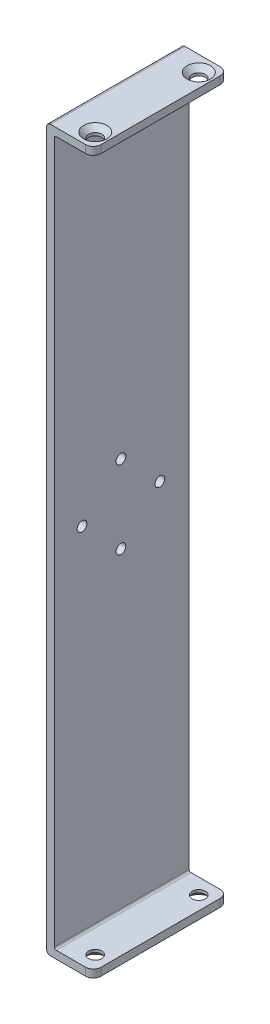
ISO-10303-21;
HEADER;
FILE_DESCRIPTION(('STEP AP214'),'2;1');
FILE_NAME('part.step','',(''),(''),'','','');
FILE_SCHEMA(('AUTOMOTIVE_DESIGN { 1 0 10303 214 1 1 1 1 }'));
ENDSEC;
DATA;
#1=APPLICATION_CONTEXT('core data for automotive mechanical design processes');
#2=APPLICATION_PROTOCOL_DEFINITION('international standard','automotive_design',2000,#1);
#3=PRODUCT_CONTEXT('',#1,'mechanical');
#4=PRODUCT('Part','Part','',(#3));
#5=PRODUCT_RELATED_PRODUCT_CATEGORY('part','',(#4));
#6=PRODUCT_DEFINITION_FORMATION('','',#4);
#7=PRODUCT_DEFINITION_CONTEXT('part definition',#1,'design');
#8=PRODUCT_DEFINITION('design','',#6,#7);
#9=PRODUCT_DEFINITION_SHAPE('','',#8);
#10=(LENGTH_UNIT() NAMED_UNIT(*) SI_UNIT(.MILLI.,.METRE.));
#11=(NAMED_UNIT(*) PLANE_ANGLE_UNIT() SI_UNIT($,.RADIAN.));
#12=(NAMED_UNIT(*) SI_UNIT($,.STERADIAN.) SOLID_ANGLE_UNIT());
#13=UNCERTAINTY_MEASURE_WITH_UNIT(LENGTH_MEASURE(1.E-05),#10,'distance_accuracy_value','');
#14=(GEOMETRIC_REPRESENTATION_CONTEXT(3) GLOBAL_UNCERTAINTY_ASSIGNED_CONTEXT((#13)) GLOBAL_UNIT_ASSIGNED_CONTEXT((#10,
#11,#12)) REPRESENTATION_CONTEXT('',''));
#15=CARTESIAN_POINT('',(0.,0.,0.));
#16=DIRECTION('',(0.,0.,1.));
#17=DIRECTION('',(1.,0.,0.));
#18=AXIS2_PLACEMENT_3D('',#15,#16,#17);
#19=CARTESIAN_POINT('',(0.,0.,34.6));
#20=DIRECTION('',(1.,0.,0.));
#21=DIRECTION('',(0.,0.,-1.));
#22=AXIS2_PLACEMENT_3D('',#19,#20,#21);
#23=PLANE('',#22);
#24=CARTESIAN_POINT('',(0.,102.5,17.5));
#25=DIRECTION('',(-1.,0.,0.));
#26=DIRECTION('',(0.,0.,1.));
#27=AXIS2_PLACEMENT_3D('',#24,#25,#26);
#28=CIRCLE('',#27,1.24999999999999);
#29=CARTESIAN_POINT('',(0.,102.5,18.75));
#30=VERTEX_POINT('',#29);
#31=EDGE_CURVE('E665',#30,#30,#28,.T.);
#32=ORIENTED_EDGE('',*,*,#31,.F.);
#33=EDGE_LOOP('',(#32));
#34=FACE_BOUND('',#33,.T.);
#35=CARTESIAN_POINT('',(0.,92.5000000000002,7.49999999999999));
#36=DIRECTION('',(-1.,0.,0.));
#37=DIRECTION('',(0.,0.,1.));
#38=AXIS2_PLACEMENT_3D('',#35,#36,#37);
#39=CIRCLE('',#38,1.24999999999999);
#40=CARTESIAN_POINT('',(0.,92.5000000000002,8.74999999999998));
#41=VERTEX_POINT('',#40);
#42=EDGE_CURVE('E659',#41,#41,#39,.T.);
#43=ORIENTED_EDGE('',*,*,#42,.F.);
#44=EDGE_LOOP('',(#43));
#45=FACE_BOUND('',#44,.T.);
#46=CARTESIAN_POINT('',(0.,82.5000000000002,17.5));
#47=DIRECTION('',(-1.,0.,0.));
#48=DIRECTION('',(0.,0.,1.));
#49=AXIS2_PLACEMENT_3D('',#46,#47,#48);
#50=CIRCLE('',#49,1.24999999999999);
#51=CARTESIAN_POINT('',(0.,82.5000000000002,18.75));
#52=VERTEX_POINT('',#51);
#53=EDGE_CURVE('E653',#52,#52,#50,.T.);
#54=ORIENTED_EDGE('',*,*,#53,.F.);
#55=EDGE_LOOP('',(#54));
#56=FACE_BOUND('',#55,.T.);
#57=CARTESIAN_POINT('',(0.,92.5000000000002,27.5));
#58=DIRECTION('',(-1.,0.,0.));
#59=DIRECTION('',(0.,0.,1.));
#60=AXIS2_PLACEMENT_3D('',#57,#58,#59);
#61=CIRCLE('',#60,1.24999999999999);
#62=CARTESIAN_POINT('',(0.,92.5000000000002,28.75));
#63=VERTEX_POINT('',#62);
#64=EDGE_CURVE('E647',#63,#63,#61,.T.);
#65=ORIENTED_EDGE('',*,*,#64,.F.);
#66=EDGE_LOOP('',(#65));
#67=FACE_BOUND('',#66,.T.);
#68=DIRECTION('',(0.,-1.,0.));
#69=VECTOR('',#68,1.);
#70=CARTESIAN_POINT('',(0.,0.,0.));
#71=LINE('',#70,#69);
#72=CARTESIAN_POINT('',(0.,184.,0.));
#73=VERTEX_POINT('',#72);
#74=CARTESIAN_POINT('',(0.,1.,0.));
#75=VERTEX_POINT('',#74);
#76=EDGE_CURVE('E177',#73,#75,#71,.T.);
#77=ORIENTED_EDGE('',*,*,#76,.T.);
#78=DIRECTION('',(0.,0.,-1.));
#79=VECTOR('',#78,1.);
#80=CARTESIAN_POINT('',(0.,1.,34.6));
#81=LINE('',#80,#79);
#82=CARTESIAN_POINT('',(0.,1.,34.6));
#83=VERTEX_POINT('',#82);
#84=EDGE_CURVE('E153',#75,#83,#81,.F.);
#85=ORIENTED_EDGE('',*,*,#84,.T.);
#86=DIRECTION('',(0.,-1.,0.));
#87=VECTOR('',#86,1.);
#88=CARTESIAN_POINT('',(0.,0.,34.6));
#89=LINE('',#88,#87);
#90=CARTESIAN_POINT('',(0.,184.,34.6));
#91=VERTEX_POINT('',#90);
#92=EDGE_CURVE('E191',#91,#83,#89,.T.);
#93=ORIENTED_EDGE('',*,*,#92,.F.);
#94=DIRECTION('',(0.,0.,-1.));
#95=VECTOR('',#94,1.);
#96=CARTESIAN_POINT('',(0.,184.,34.6));
#97=LINE('',#96,#95);
#98=EDGE_CURVE('E158',#91,#73,#97,.T.);
#99=ORIENTED_EDGE('',*,*,#98,.T.);
#100=EDGE_LOOP('',(#77,#85,#93,#99));
#101=FACE_BOUND('',#100,.T.);
#102=ADVANCED_FACE('F35',(#34,#45,#56,#67,#101),#23,.F.);
#103=CARTESIAN_POINT('',(0.,0.,34.6));
#104=DIRECTION('',(0.,1.,0.));
#105=DIRECTION('',(0.,0.,1.));
#106=AXIS2_PLACEMENT_3D('',#103,#104,#105);
#107=PLANE('',#106);
#108=CARTESIAN_POINT('',(8.50000000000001,0.,30.6));
#109=DIRECTION('',(0.,-1.,0.));
#110=DIRECTION('',(0.,0.,-1.));
#111=AXIS2_PLACEMENT_3D('',#108,#109,#110);
#112=CIRCLE('',#111,3.);
#113=CARTESIAN_POINT('',(8.50000000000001,0.,27.6));
#114=VERTEX_POINT('',#113);
#115=EDGE_CURVE('E641',#114,#114,#112,.T.);
#116=ORIENTED_EDGE('',*,*,#115,.F.);
#117=EDGE_LOOP('',(#116));
#118=FACE_BOUND('',#117,.T.);
#119=CARTESIAN_POINT('',(8.50000000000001,0.,4.));
#120=DIRECTION('',(0.,-1.,0.));
#121=DIRECTION('',(0.,0.,-1.));
#122=AXIS2_PLACEMENT_3D('',#119,#120,#121);
#123=CIRCLE('',#122,3.);
#124=CARTESIAN_POINT('',(8.50000000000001,0.,0.999999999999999));
#125=VERTEX_POINT('',#124);
#126=EDGE_CURVE('E252',#125,#125,#123,.T.);
#127=ORIENTED_EDGE('',*,*,#126,.F.);
#128=EDGE_LOOP('',(#127));
#129=FACE_BOUND('',#128,.T.);
#130=DIRECTION('',(0.,0.,-1.));
#131=VECTOR('',#130,1.);
#132=CARTESIAN_POINT('',(12.,0.,34.6));
#133=LINE('',#132,#131);
#134=CARTESIAN_POINT('',(12.,0.,32.6));
#135=VERTEX_POINT('',#134);
#136=CARTESIAN_POINT('',(12.,0.,2.));
#137=VERTEX_POINT('',#136);
#138=EDGE_CURVE('E170',#135,#137,#133,.T.);
#139=ORIENTED_EDGE('',*,*,#138,.F.);
#140=CARTESIAN_POINT('',(10.,0.,32.6));
#141=DIRECTION('',(0.,1.,0.));
#142=DIRECTION('',(0.,0.,1.));
#143=AXIS2_PLACEMENT_3D('',#140,#141,#142);
#144=CIRCLE('',#143,2.);
#145=CARTESIAN_POINT('',(10.,0.,34.6));
#146=VERTEX_POINT('',#145);
#147=EDGE_CURVE('E270',#135,#146,#144,.F.);
#148=ORIENTED_EDGE('',*,*,#147,.T.);
#149=DIRECTION('',(1.,0.,0.));
#150=VECTOR('',#149,1.);
#151=CARTESIAN_POINT('',(0.,0.,34.6));
#152=LINE('',#151,#150);
#153=CARTESIAN_POINT('',(1.,0.,34.6));
#154=VERTEX_POINT('',#153);
#155=EDGE_CURVE('E169',#154,#146,#152,.T.);
#156=ORIENTED_EDGE('',*,*,#155,.F.);
#157=DIRECTION('',(0.,0.,-1.));
#158=VECTOR('',#157,1.);
#159=CARTESIAN_POINT('',(1.,0.,34.6));
#160=LINE('',#159,#158);
#161=CARTESIAN_POINT('',(1.,0.,0.));
#162=VERTEX_POINT('',#161);
#163=EDGE_CURVE('E152',#154,#162,#160,.T.);
#164=ORIENTED_EDGE('',*,*,#163,.T.);
#165=DIRECTION('',(1.,0.,0.));
#166=VECTOR('',#165,1.);
#167=CARTESIAN_POINT('',(0.,0.,0.));
#168=LINE('',#167,#166);
#169=CARTESIAN_POINT('',(10.,0.,0.));
#170=VERTEX_POINT('',#169);
#171=EDGE_CURVE('E166',#162,#170,#168,.T.);
#172=ORIENTED_EDGE('',*,*,#171,.T.);
#173=CARTESIAN_POINT('',(10.,0.,2.));
#174=DIRECTION('',(0.,1.,0.));
#175=DIRECTION('',(0.,0.,1.));
#176=AXIS2_PLACEMENT_3D('',#173,#174,#175);
#177=CIRCLE('',#176,2.);
#178=EDGE_CURVE('E268',#170,#137,#177,.F.);
#179=ORIENTED_EDGE('',*,*,#178,.T.);
#180=EDGE_LOOP('',(#139,#148,#156,#164,#172,#179));
#181=FACE_BOUND('',#180,.T.);
#182=ADVANCED_FACE('F165',(#118,#129,#181),#107,.F.);
#183=CARTESIAN_POINT('',(12.,0.,34.6));
#184=DIRECTION('',(-1.,0.,0.));
#185=DIRECTION('',(0.,0.,1.));
#186=AXIS2_PLACEMENT_3D('',#183,#184,#185);
#187=PLANE('',#186);
#188=DIRECTION('',(0.,0.,-1.));
#189=VECTOR('',#188,1.);
#190=CARTESIAN_POINT('',(12.,2.,34.6));
#191=LINE('',#190,#189);
#192=CARTESIAN_POINT('',(12.,2.,32.6));
#193=VERTEX_POINT('',#192);
#194=CARTESIAN_POINT('',(12.,2.,2.));
#195=VERTEX_POINT('',#194);
#196=EDGE_CURVE('E198',#193,#195,#191,.T.);
#197=ORIENTED_EDGE('',*,*,#196,.F.);
#198=DIRECTION('',(0.,1.,0.));
#199=VECTOR('',#198,1.);
#200=CARTESIAN_POINT('',(12.,0.,32.6));
#201=LINE('',#200,#199);
#202=EDGE_CURVE('E266',#193,#135,#201,.F.);
#203=ORIENTED_EDGE('',*,*,#202,.T.);
#204=ORIENTED_EDGE('',*,*,#138,.T.);
#205=DIRECTION('',(0.,1.,0.));
#206=VECTOR('',#205,1.);
#207=CARTESIAN_POINT('',(12.,2.,2.));
#208=LINE('',#207,#206);
#209=EDGE_CURVE('E263',#137,#195,#208,.T.);
#210=ORIENTED_EDGE('',*,*,#209,.T.);
#211=EDGE_LOOP('',(#197,#203,#204,#210));
#212=FACE_BOUND('',#211,.T.);
#213=ADVANCED_FACE('F340',(#212),#187,.F.);
#214=CARTESIAN_POINT('',(12.,2.,34.6));
#215=DIRECTION('',(0.,-1.,0.));
#216=DIRECTION('',(1.,0.,0.));
#217=AXIS2_PLACEMENT_3D('',#214,#215,#216);
#218=PLANE('',#217);
#219=CARTESIAN_POINT('',(8.50000000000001,2.,30.6));
#220=DIRECTION('',(0.,-1.,0.));
#221=DIRECTION('',(1.,0.,0.));
#222=AXIS2_PLACEMENT_3D('',#219,#220,#221);
#223=CIRCLE('',#222,1.69999999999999);
#224=CARTESIAN_POINT('',(10.2,2.,30.6));
#225=VERTEX_POINT('',#224);
#226=EDGE_CURVE('E249',#225,#225,#223,.T.);
#227=ORIENTED_EDGE('',*,*,#226,.T.);
#228=EDGE_LOOP('',(#227));
#229=FACE_BOUND('',#228,.T.);
#230=CARTESIAN_POINT('',(8.50000000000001,2.,4.));
#231=DIRECTION('',(0.,-1.,0.));
#232=DIRECTION('',(1.,0.,0.));
#233=AXIS2_PLACEMENT_3D('',#230,#231,#232);
#234=CIRCLE('',#233,1.69999999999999);
#235=CARTESIAN_POINT('',(10.2,2.,4.));
#236=VERTEX_POINT('',#235);
#237=EDGE_CURVE('E244',#236,#236,#234,.T.);
#238=ORIENTED_EDGE('',*,*,#237,.T.);
#239=EDGE_LOOP('',(#238));
#240=FACE_BOUND('',#239,.T.);
#241=DIRECTION('',(-1.,0.,0.));
#242=VECTOR('',#241,1.);
#243=CARTESIAN_POINT('',(12.,2.,34.6));
#244=LINE('',#243,#242);
#245=CARTESIAN_POINT('',(10.,2.,34.6));
#246=VERTEX_POINT('',#245);
#247=CARTESIAN_POINT('',(2.50000000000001,2.,34.6));
#248=VERTEX_POINT('',#247);
#249=EDGE_CURVE('E315',#246,#248,#244,.T.);
#250=ORIENTED_EDGE('',*,*,#249,.F.);
#251=CARTESIAN_POINT('',(10.,2.,32.6));
#252=DIRECTION('',(0.,-1.,0.));
#253=DIRECTION('',(1.,0.,0.));
#254=AXIS2_PLACEMENT_3D('',#251,#252,#253);
#255=CIRCLE('',#254,2.);
#256=EDGE_CURVE('E261',#246,#193,#255,.F.);
#257=ORIENTED_EDGE('',*,*,#256,.T.);
#258=ORIENTED_EDGE('',*,*,#196,.T.);
#259=CARTESIAN_POINT('',(10.,2.,2.));
#260=DIRECTION('',(0.,-1.,0.));
#261=DIRECTION('',(1.,0.,0.));
#262=AXIS2_PLACEMENT_3D('',#259,#260,#261);
#263=CIRCLE('',#262,2.);
#264=CARTESIAN_POINT('',(10.,2.,0.));
#265=VERTEX_POINT('',#264);
#266=EDGE_CURVE('E259',#195,#265,#263,.F.);
#267=ORIENTED_EDGE('',*,*,#266,.T.);
#268=DIRECTION('',(-1.,0.,0.));
#269=VECTOR('',#268,1.);
#270=CARTESIAN_POINT('',(12.,2.,0.));
#271=LINE('',#270,#269);
#272=CARTESIAN_POINT('',(2.50000000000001,2.,0.));
#273=VERTEX_POINT('',#272);
#274=EDGE_CURVE('E176',#265,#273,#271,.T.);
#275=ORIENTED_EDGE('',*,*,#274,.T.);
#276=DIRECTION('',(0.,0.,-1.));
#277=VECTOR('',#276,1.);
#278=CARTESIAN_POINT('',(2.50000000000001,2.,34.6));
#279=LINE('',#278,#277);
#280=EDGE_CURVE('E231',#273,#248,#279,.F.);
#281=ORIENTED_EDGE('',*,*,#280,.T.);
#282=EDGE_LOOP('',(#250,#257,#258,#267,#275,#281));
#283=FACE_BOUND('',#282,.T.);
#284=ADVANCED_FACE('F346',(#229,#240,#283),#218,.F.);
#285=CARTESIAN_POINT('',(1.99999999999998,183.,34.6));
#286=DIRECTION('',(-1.,0.,0.));
#287=DIRECTION('',(0.,-1.,0.));
#288=AXIS2_PLACEMENT_3D('',#285,#286,#287);
#289=PLANE('',#288);
#290=CARTESIAN_POINT('',(1.99999999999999,102.5,17.5));
#291=DIRECTION('',(-1.,0.,0.));
#292=DIRECTION('',(0.,-1.,0.));
#293=AXIS2_PLACEMENT_3D('',#290,#291,#292);
#294=CIRCLE('',#293,1.24999999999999);
#295=CARTESIAN_POINT('',(1.99999999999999,101.25,17.5));
#296=VERTEX_POINT('',#295);
#297=EDGE_CURVE('E662',#296,#296,#294,.T.);
#298=ORIENTED_EDGE('',*,*,#297,.T.);
#299=EDGE_LOOP('',(#298));
#300=FACE_BOUND('',#299,.T.);
#301=CARTESIAN_POINT('',(1.99999999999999,92.5000000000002,7.49999999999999));
#302=DIRECTION('',(-1.,0.,0.));
#303=DIRECTION('',(0.,-1.,0.));
#304=AXIS2_PLACEMENT_3D('',#301,#302,#303);
#305=CIRCLE('',#304,1.24999999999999);
#306=CARTESIAN_POINT('',(1.99999999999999,91.2500000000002,7.49999999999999));
#307=VERTEX_POINT('',#306);
#308=EDGE_CURVE('E656',#307,#307,#305,.T.);
#309=ORIENTED_EDGE('',*,*,#308,.T.);
#310=EDGE_LOOP('',(#309));
#311=FACE_BOUND('',#310,.T.);
#312=CARTESIAN_POINT('',(2.,82.5000000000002,17.5));
#313=DIRECTION('',(-1.,0.,0.));
#314=DIRECTION('',(0.,-1.,0.));
#315=AXIS2_PLACEMENT_3D('',#312,#313,#314);
#316=CIRCLE('',#315,1.24999999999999);
#317=CARTESIAN_POINT('',(2.,81.2500000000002,17.5));
#318=VERTEX_POINT('',#317);
#319=EDGE_CURVE('E650',#318,#318,#316,.T.);
#320=ORIENTED_EDGE('',*,*,#319,.T.);
#321=EDGE_LOOP('',(#320));
#322=FACE_BOUND('',#321,.T.);
#323=CARTESIAN_POINT('',(1.99999999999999,92.5000000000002,27.5));
#324=DIRECTION('',(-1.,0.,0.));
#325=DIRECTION('',(0.,-1.,0.));
#326=AXIS2_PLACEMENT_3D('',#323,#324,#325);
#327=CIRCLE('',#326,1.24999999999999);
#328=CARTESIAN_POINT('',(1.99999999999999,91.2500000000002,27.5));
#329=VERTEX_POINT('',#328);
#330=EDGE_CURVE('E644',#329,#329,#327,.T.);
#331=ORIENTED_EDGE('',*,*,#330,.T.);
#332=EDGE_LOOP('',(#331));
#333=FACE_BOUND('',#332,.T.);
#334=DIRECTION('',(0.,1.,0.));
#335=VECTOR('',#334,1.);
#336=CARTESIAN_POINT('',(1.99999999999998,183.,0.));
#337=LINE('',#336,#335);
#338=CARTESIAN_POINT('',(2.00000000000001,2.5,0.));
#339=VERTEX_POINT('',#338);
#340=CARTESIAN_POINT('',(1.99999999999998,182.5,0.));
#341=VERTEX_POINT('',#340);
#342=EDGE_CURVE('E179',#339,#341,#337,.T.);
#343=ORIENTED_EDGE('',*,*,#342,.T.);
#344=DIRECTION('',(0.,0.,-1.));
#345=VECTOR('',#344,1.);
#346=CARTESIAN_POINT('',(1.99999999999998,182.5,34.6));
#347=LINE('',#346,#345);
#348=CARTESIAN_POINT('',(1.99999999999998,182.5,34.6));
#349=VERTEX_POINT('',#348);
#350=EDGE_CURVE('E229',#341,#349,#347,.F.);
#351=ORIENTED_EDGE('',*,*,#350,.T.);
#352=DIRECTION('',(0.,1.,0.));
#353=VECTOR('',#352,1.);
#354=CARTESIAN_POINT('',(1.99999999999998,183.,34.6));
#355=LINE('',#354,#353);
#356=CARTESIAN_POINT('',(2.00000000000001,2.5,34.6));
#357=VERTEX_POINT('',#356);
#358=EDGE_CURVE('E295',#357,#349,#355,.T.);
#359=ORIENTED_EDGE('',*,*,#358,.F.);
#360=DIRECTION('',(0.,0.,-1.));
#361=VECTOR('',#360,1.);
#362=CARTESIAN_POINT('',(2.00000000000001,2.5,0.));
#363=LINE('',#362,#361);
#364=EDGE_CURVE('E226',#357,#339,#363,.T.);
#365=ORIENTED_EDGE('',*,*,#364,.T.);
#366=EDGE_LOOP('',(#343,#351,#359,#365));
#367=FACE_BOUND('',#366,.T.);
#368=ADVANCED_FACE('F329',(#300,#311,#322,#333,#367),#289,.F.);
#369=CARTESIAN_POINT('',(12.,183.,34.6));
#370=DIRECTION('',(0.,1.,0.));
#371=DIRECTION('',(0.,0.,1.));
#372=AXIS2_PLACEMENT_3D('',#369,#370,#371);
#373=PLANE('',#372);
#374=CARTESIAN_POINT('',(8.5,183.,4.));
#375=DIRECTION('',(0.,1.,0.));
#376=DIRECTION('',(0.,0.,1.));
#377=AXIS2_PLACEMENT_3D('',#374,#375,#376);
#378=CIRCLE('',#377,1.69999999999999);
#379=CARTESIAN_POINT('',(8.5,183.,5.69999999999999));
#380=VERTEX_POINT('',#379);
#381=EDGE_CURVE('E206',#380,#380,#378,.T.);
#382=ORIENTED_EDGE('',*,*,#381,.T.);
#383=EDGE_LOOP('',(#382));
#384=FACE_BOUND('',#383,.T.);
#385=CARTESIAN_POINT('',(8.5,183.,30.6));
#386=DIRECTION('',(0.,1.,0.));
#387=DIRECTION('',(0.,0.,1.));
#388=AXIS2_PLACEMENT_3D('',#385,#386,#387);
#389=CIRCLE('',#388,1.69999999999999);
#390=CARTESIAN_POINT('',(8.5,183.,32.3));
#391=VERTEX_POINT('',#390);
#392=EDGE_CURVE('E181',#391,#391,#389,.T.);
#393=ORIENTED_EDGE('',*,*,#392,.T.);
#394=EDGE_LOOP('',(#393));
#395=FACE_BOUND('',#394,.T.);
#396=DIRECTION('',(1.,0.,0.));
#397=VECTOR('',#396,1.);
#398=CARTESIAN_POINT('',(12.,183.,0.));
#399=LINE('',#398,#397);
#400=CARTESIAN_POINT('',(2.49999999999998,183.,0.));
#401=VERTEX_POINT('',#400);
#402=CARTESIAN_POINT('',(10.,183.,0.));
#403=VERTEX_POINT('',#402);
#404=EDGE_CURVE('E187',#401,#403,#399,.T.);
#405=ORIENTED_EDGE('',*,*,#404,.T.);
#406=CARTESIAN_POINT('',(10.,183.,2.));
#407=DIRECTION('',(0.,1.,0.));
#408=DIRECTION('',(0.,0.,1.));
#409=AXIS2_PLACEMENT_3D('',#406,#407,#408);
#410=CIRCLE('',#409,2.);
#411=CARTESIAN_POINT('',(12.,183.,2.));
#412=VERTEX_POINT('',#411);
#413=EDGE_CURVE('E11',#403,#412,#410,.F.);
#414=ORIENTED_EDGE('',*,*,#413,.T.);
#415=DIRECTION('',(0.,0.,-1.));
#416=VECTOR('',#415,1.);
#417=CARTESIAN_POINT('',(12.,183.,34.6));
#418=LINE('',#417,#416);
#419=CARTESIAN_POINT('',(12.,183.,32.6));
#420=VERTEX_POINT('',#419);
#421=EDGE_CURVE('E195',#420,#412,#418,.T.);
#422=ORIENTED_EDGE('',*,*,#421,.F.);
#423=CARTESIAN_POINT('',(10.,183.,32.6));
#424=DIRECTION('',(0.,1.,0.));
#425=DIRECTION('',(0.,0.,1.));
#426=AXIS2_PLACEMENT_3D('',#423,#424,#425);
#427=CIRCLE('',#426,2.);
#428=CARTESIAN_POINT('',(10.,183.,34.6));
#429=VERTEX_POINT('',#428);
#430=EDGE_CURVE('E43',#420,#429,#427,.F.);
#431=ORIENTED_EDGE('',*,*,#430,.T.);
#432=DIRECTION('',(1.,0.,0.));
#433=VECTOR('',#432,1.);
#434=CARTESIAN_POINT('',(12.,183.,34.6));
#435=LINE('',#434,#433);
#436=CARTESIAN_POINT('',(2.49999999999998,183.,34.6));
#437=VERTEX_POINT('',#436);
#438=EDGE_CURVE('E286',#437,#429,#435,.T.);
#439=ORIENTED_EDGE('',*,*,#438,.F.);
#440=DIRECTION('',(0.,0.,-1.));
#441=VECTOR('',#440,1.);
#442=CARTESIAN_POINT('',(2.49999999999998,183.,0.));
#443=LINE('',#442,#441);
#444=EDGE_CURVE('E223',#437,#401,#443,.T.);
#445=ORIENTED_EDGE('',*,*,#444,.T.);
#446=EDGE_LOOP('',(#405,#414,#422,#431,#439,#445));
#447=FACE_BOUND('',#446,.T.);
#448=ADVANCED_FACE('F285',(#384,#395,#447),#373,.F.);
#449=CARTESIAN_POINT('',(12.,183.,34.6));
#450=DIRECTION('',(-1.,0.,0.));
#451=DIRECTION('',(0.,-1.,0.));
#452=AXIS2_PLACEMENT_3D('',#449,#450,#451);
#453=PLANE('',#452);
#454=ORIENTED_EDGE('',*,*,#421,.T.);
#455=DIRECTION('',(0.,1.,0.));
#456=VECTOR('',#455,1.);
#457=CARTESIAN_POINT('',(12.,185.,2.));
#458=LINE('',#457,#456);
#459=CARTESIAN_POINT('',(12.,185.,2.));
#460=VERTEX_POINT('',#459);
#461=EDGE_CURVE('E276',#412,#460,#458,.T.);
#462=ORIENTED_EDGE('',*,*,#461,.T.);
#463=DIRECTION('',(0.,0.,-1.));
#464=VECTOR('',#463,1.);
#465=CARTESIAN_POINT('',(12.,185.,34.6));
#466=LINE('',#465,#464);
#467=CARTESIAN_POINT('',(12.,185.,32.6));
#468=VERTEX_POINT('',#467);
#469=EDGE_CURVE('E192',#468,#460,#466,.T.);
#470=ORIENTED_EDGE('',*,*,#469,.F.);
#471=DIRECTION('',(0.,1.,0.));
#472=VECTOR('',#471,1.);
#473=CARTESIAN_POINT('',(12.,183.,32.6));
#474=LINE('',#473,#472);
#475=EDGE_CURVE('E55',#468,#420,#474,.F.);
#476=ORIENTED_EDGE('',*,*,#475,.T.);
#477=EDGE_LOOP('',(#454,#462,#470,#476));
#478=FACE_BOUND('',#477,.T.);
#479=ADVANCED_FACE('F299',(#478),#453,.F.);
#480=CARTESIAN_POINT('',(0.,185.,34.6));
#481=DIRECTION('',(0.,-1.,0.));
#482=DIRECTION('',(0.,0.,-1.));
#483=AXIS2_PLACEMENT_3D('',#480,#481,#482);
#484=PLANE('',#483);
#485=CARTESIAN_POINT('',(8.5,185.,4.));
#486=DIRECTION('',(0.,1.,0.));
#487=DIRECTION('',(0.,0.,1.));
#488=AXIS2_PLACEMENT_3D('',#485,#486,#487);
#489=CIRCLE('',#488,3.);
#490=CARTESIAN_POINT('',(8.5,185.,7.));
#491=VERTEX_POINT('',#490);
#492=EDGE_CURVE('E247',#491,#491,#489,.T.);
#493=ORIENTED_EDGE('',*,*,#492,.F.);
#494=EDGE_LOOP('',(#493));
#495=FACE_BOUND('',#494,.T.);
#496=CARTESIAN_POINT('',(8.5,185.,30.6));
#497=DIRECTION('',(0.,1.,0.));
#498=DIRECTION('',(0.,0.,1.));
#499=AXIS2_PLACEMENT_3D('',#496,#497,#498);
#500=CIRCLE('',#499,3.);
#501=CARTESIAN_POINT('',(8.5,185.,33.6));
#502=VERTEX_POINT('',#501);
#503=EDGE_CURVE('E208',#502,#502,#500,.T.);
#504=ORIENTED_EDGE('',*,*,#503,.F.);
#505=EDGE_LOOP('',(#504));
#506=FACE_BOUND('',#505,.T.);
#507=ORIENTED_EDGE('',*,*,#469,.T.);
#508=CARTESIAN_POINT('',(10.,185.,2.));
#509=DIRECTION('',(0.,-1.,0.));
#510=DIRECTION('',(0.,0.,-1.));
#511=AXIS2_PLACEMENT_3D('',#508,#509,#510);
#512=CIRCLE('',#511,2.);
#513=CARTESIAN_POINT('',(10.,185.,0.));
#514=VERTEX_POINT('',#513);
#515=EDGE_CURVE('E281',#460,#514,#512,.F.);
#516=ORIENTED_EDGE('',*,*,#515,.T.);
#517=DIRECTION('',(-1.,0.,0.));
#518=VECTOR('',#517,1.);
#519=CARTESIAN_POINT('',(0.,185.,0.));
#520=LINE('',#519,#518);
#521=CARTESIAN_POINT('',(1.,185.,0.));
#522=VERTEX_POINT('',#521);
#523=EDGE_CURVE('E189',#514,#522,#520,.T.);
#524=ORIENTED_EDGE('',*,*,#523,.T.);
#525=DIRECTION('',(0.,0.,-1.));
#526=VECTOR('',#525,1.);
#527=CARTESIAN_POINT('',(1.,185.,34.6));
#528=LINE('',#527,#526);
#529=CARTESIAN_POINT('',(1.,185.,34.6));
#530=VERTEX_POINT('',#529);
#531=EDGE_CURVE('E220',#522,#530,#528,.F.);
#532=ORIENTED_EDGE('',*,*,#531,.T.);
#533=DIRECTION('',(-1.,0.,0.));
#534=VECTOR('',#533,1.);
#535=CARTESIAN_POINT('',(0.,185.,34.6));
#536=LINE('',#535,#534);
#537=CARTESIAN_POINT('',(10.,185.,34.6));
#538=VERTEX_POINT('',#537);
#539=EDGE_CURVE('E196',#538,#530,#536,.T.);
#540=ORIENTED_EDGE('',*,*,#539,.F.);
#541=CARTESIAN_POINT('',(10.,185.,32.6));
#542=DIRECTION('',(0.,-1.,0.));
#543=DIRECTION('',(0.,0.,-1.));
#544=AXIS2_PLACEMENT_3D('',#541,#542,#543);
#545=CIRCLE('',#544,2.);
#546=EDGE_CURVE('E279',#538,#468,#545,.F.);
#547=ORIENTED_EDGE('',*,*,#546,.T.);
#548=EDGE_LOOP('',(#507,#516,#524,#532,#540,#547));
#549=FACE_BOUND('',#548,.T.);
#550=ADVANCED_FACE('F298',(#495,#506,#549),#484,.F.);
#551=CARTESIAN_POINT('',(0.,0.,34.6));
#552=DIRECTION('',(0.,0.,-1.));
#553=DIRECTION('',(-1.,0.,0.));
#554=AXIS2_PLACEMENT_3D('',#551,#552,#553);
#555=PLANE('',#554);
#556=ORIENTED_EDGE('',*,*,#155,.T.);
#557=DIRECTION('',(0.,1.,0.));
#558=VECTOR('',#557,1.);
#559=CARTESIAN_POINT('',(10.,0.,34.6));
#560=LINE('',#559,#558);
#561=EDGE_CURVE('E256',#146,#246,#560,.T.);
#562=ORIENTED_EDGE('',*,*,#561,.T.);
#563=ORIENTED_EDGE('',*,*,#249,.T.);
#564=CARTESIAN_POINT('',(2.50000000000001,2.5,34.6));
#565=DIRECTION('',(0.,0.,-1.));
#566=DIRECTION('',(-1.,0.,0.));
#567=AXIS2_PLACEMENT_3D('',#564,#565,#566);
#568=CIRCLE('',#567,0.5);
#569=EDGE_CURVE('E241',#248,#357,#568,.T.);
#570=ORIENTED_EDGE('',*,*,#569,.T.);
#571=ORIENTED_EDGE('',*,*,#358,.T.);
#572=CARTESIAN_POINT('',(2.49999999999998,182.5,34.6));
#573=DIRECTION('',(0.,0.,-1.));
#574=DIRECTION('',(-1.,0.,0.));
#575=AXIS2_PLACEMENT_3D('',#572,#573,#574);
#576=CIRCLE('',#575,0.5);
#577=EDGE_CURVE('E236',#349,#437,#576,.T.);
#578=ORIENTED_EDGE('',*,*,#577,.T.);
#579=ORIENTED_EDGE('',*,*,#438,.T.);
#580=DIRECTION('',(0.,1.,0.));
#581=VECTOR('',#580,1.);
#582=CARTESIAN_POINT('',(10.0000000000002,0.,34.6));
#583=LINE('',#582,#581);
#584=EDGE_CURVE('E243',#429,#538,#583,.T.);
#585=ORIENTED_EDGE('',*,*,#584,.T.);
#586=ORIENTED_EDGE('',*,*,#539,.T.);
#587=CARTESIAN_POINT('',(1.,184.,34.6));
#588=DIRECTION('',(0.,0.,-1.));
#589=DIRECTION('',(-1.,0.,0.));
#590=AXIS2_PLACEMENT_3D('',#587,#588,#589);
#591=CIRCLE('',#590,1.);
#592=EDGE_CURVE('E216',#530,#91,#591,.F.);
#593=ORIENTED_EDGE('',*,*,#592,.T.);
#594=ORIENTED_EDGE('',*,*,#92,.T.);
#595=CARTESIAN_POINT('',(1.,1.,34.6));
#596=DIRECTION('',(0.,0.,-1.));
#597=DIRECTION('',(-1.,0.,0.));
#598=AXIS2_PLACEMENT_3D('',#595,#596,#597);
#599=CIRCLE('',#598,1.);
#600=EDGE_CURVE('E218',#83,#154,#599,.F.);
#601=ORIENTED_EDGE('',*,*,#600,.T.);
#602=EDGE_LOOP('',(#556,#562,#563,#570,#571,#578,#579,#585,#586,#593,#594,#601));
#603=FACE_BOUND('',#602,.T.);
#604=ADVANCED_FACE('F291',(#603),#555,.F.);
#605=CARTESIAN_POINT('',(0.,0.,0.));
#606=DIRECTION('',(0.,0.,-1.));
#607=DIRECTION('',(-1.,0.,0.));
#608=AXIS2_PLACEMENT_3D('',#605,#606,#607);
#609=PLANE('',#608);
#610=ORIENTED_EDGE('',*,*,#274,.F.);
#611=DIRECTION('',(0.,1.,0.));
#612=VECTOR('',#611,1.);
#613=CARTESIAN_POINT('',(10.,0.,0.));
#614=LINE('',#613,#612);
#615=EDGE_CURVE('E175',#265,#170,#614,.F.);
#616=ORIENTED_EDGE('',*,*,#615,.T.);
#617=ORIENTED_EDGE('',*,*,#171,.F.);
#618=CARTESIAN_POINT('',(1.,1.,0.));
#619=DIRECTION('',(0.,0.,-1.));
#620=DIRECTION('',(-1.,0.,0.));
#621=AXIS2_PLACEMENT_3D('',#618,#619,#620);
#622=CIRCLE('',#621,1.);
#623=EDGE_CURVE('E148',#162,#75,#622,.T.);
#624=ORIENTED_EDGE('',*,*,#623,.T.);
#625=ORIENTED_EDGE('',*,*,#76,.F.);
#626=CARTESIAN_POINT('',(1.,184.,0.));
#627=DIRECTION('',(0.,0.,-1.));
#628=DIRECTION('',(-1.,0.,0.));
#629=AXIS2_PLACEMENT_3D('',#626,#627,#628);
#630=CIRCLE('',#629,1.);
#631=EDGE_CURVE('E159',#73,#522,#630,.T.);
#632=ORIENTED_EDGE('',*,*,#631,.T.);
#633=ORIENTED_EDGE('',*,*,#523,.F.);
#634=DIRECTION('',(0.,1.,0.));
#635=VECTOR('',#634,1.);
#636=CARTESIAN_POINT('',(10.,183.,0.));
#637=LINE('',#636,#635);
#638=EDGE_CURVE('E272',#514,#403,#637,.F.);
#639=ORIENTED_EDGE('',*,*,#638,.T.);
#640=ORIENTED_EDGE('',*,*,#404,.F.);
#641=CARTESIAN_POINT('',(2.49999999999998,182.5,0.));
#642=DIRECTION('',(0.,0.,-1.));
#643=DIRECTION('',(-1.,0.,0.));
#644=AXIS2_PLACEMENT_3D('',#641,#642,#643);
#645=CIRCLE('',#644,0.5);
#646=EDGE_CURVE('E234',#401,#341,#645,.F.);
#647=ORIENTED_EDGE('',*,*,#646,.T.);
#648=ORIENTED_EDGE('',*,*,#342,.F.);
#649=CARTESIAN_POINT('',(2.50000000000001,2.5,0.));
#650=DIRECTION('',(0.,0.,-1.));
#651=DIRECTION('',(-1.,0.,0.));
#652=AXIS2_PLACEMENT_3D('',#649,#650,#651);
#653=CIRCLE('',#652,0.5);
#654=EDGE_CURVE('E238',#339,#273,#653,.F.);
#655=ORIENTED_EDGE('',*,*,#654,.T.);
#656=EDGE_LOOP('',(#610,#616,#617,#624,#625,#632,#633,#639,#640,#647,#648,#655));
#657=FACE_BOUND('',#656,.T.);
#658=ADVANCED_FACE('F173',(#657),#609,.T.);
#659=CARTESIAN_POINT('',(8.5,185.,30.6));
#660=DIRECTION('',(0.,1.,0.));
#661=DIRECTION('',(0.,0.,1.));
#662=AXIS2_PLACEMENT_3D('',#659,#660,#661);
#663=CYLINDRICAL_SURFACE('',#662,1.69999999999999);
#664=CARTESIAN_POINT('',(8.5,183.7,30.6));
#665=DIRECTION('',(0.,1.,0.));
#666=DIRECTION('',(0.,0.,1.));
#667=AXIS2_PLACEMENT_3D('',#664,#665,#666);
#668=CIRCLE('',#667,1.7);
#669=CARTESIAN_POINT('',(8.5,183.7,32.3));
#670=VERTEX_POINT('',#669);
#671=EDGE_CURVE('E205',#670,#670,#668,.T.);
#672=ORIENTED_EDGE('',*,*,#671,.T.);
#673=EDGE_LOOP('',(#672));
#674=FACE_BOUND('',#673,.T.);
#675=ORIENTED_EDGE('',*,*,#392,.F.);
#676=EDGE_LOOP('',(#675));
#677=FACE_BOUND('',#676,.T.);
#678=ADVANCED_FACE('F416',(#674,#677),#663,.F.);
#679=CARTESIAN_POINT('',(8.5,185.,30.6));
#680=DIRECTION('',(0.,1.,0.));
#681=DIRECTION('',(0.,0.,1.));
#682=AXIS2_PLACEMENT_3D('',#679,#680,#681);
#683=CONICAL_SURFACE('',#682,3.,0.78539816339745);
#684=ORIENTED_EDGE('',*,*,#671,.F.);
#685=EDGE_LOOP('',(#684));
#686=FACE_BOUND('',#685,.T.);
#687=ORIENTED_EDGE('',*,*,#503,.T.);
#688=EDGE_LOOP('',(#687));
#689=FACE_BOUND('',#688,.T.);
#690=ADVANCED_FACE('F601',(#686,#689),#683,.F.);
#691=CARTESIAN_POINT('',(8.5,185.,4.));
#692=DIRECTION('',(0.,1.,0.));
#693=DIRECTION('',(0.,0.,1.));
#694=AXIS2_PLACEMENT_3D('',#691,#692,#693);
#695=CYLINDRICAL_SURFACE('',#694,1.69999999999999);
#696=CARTESIAN_POINT('',(8.5,183.7,4.));
#697=DIRECTION('',(0.,1.,0.));
#698=DIRECTION('',(0.,0.,1.));
#699=AXIS2_PLACEMENT_3D('',#696,#697,#698);
#700=CIRCLE('',#699,1.7);
#701=CARTESIAN_POINT('',(8.5,183.7,5.7));
#702=VERTEX_POINT('',#701);
#703=EDGE_CURVE('E209',#702,#702,#700,.T.);
#704=ORIENTED_EDGE('',*,*,#703,.T.);
#705=EDGE_LOOP('',(#704));
#706=FACE_BOUND('',#705,.T.);
#707=ORIENTED_EDGE('',*,*,#381,.F.);
#708=EDGE_LOOP('',(#707));
#709=FACE_BOUND('',#708,.T.);
#710=ADVANCED_FACE('F591',(#706,#709),#695,.F.);
#711=CARTESIAN_POINT('',(8.5,185.,4.));
#712=DIRECTION('',(0.,1.,0.));
#713=DIRECTION('',(0.,0.,1.));
#714=AXIS2_PLACEMENT_3D('',#711,#712,#713);
#715=CONICAL_SURFACE('',#714,3.,0.78539816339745);
#716=ORIENTED_EDGE('',*,*,#703,.F.);
#717=EDGE_LOOP('',(#716));
#718=FACE_BOUND('',#717,.T.);
#719=ORIENTED_EDGE('',*,*,#492,.T.);
#720=EDGE_LOOP('',(#719));
#721=FACE_BOUND('',#720,.T.);
#722=ADVANCED_FACE('F371',(#718,#721),#715,.F.);
#723=CARTESIAN_POINT('',(1.,1.,34.6));
#724=DIRECTION('',(0.,0.,-1.));
#725=DIRECTION('',(-1.,0.,0.));
#726=AXIS2_PLACEMENT_3D('',#723,#724,#725);
#727=CYLINDRICAL_SURFACE('',#726,1.);
#728=ORIENTED_EDGE('',*,*,#600,.F.);
#729=ORIENTED_EDGE('',*,*,#84,.F.);
#730=ORIENTED_EDGE('',*,*,#623,.F.);
#731=ORIENTED_EDGE('',*,*,#163,.F.);
#732=EDGE_LOOP('',(#728,#729,#730,#731));
#733=FACE_BOUND('',#732,.T.);
#734=ADVANCED_FACE('F151',(#733),#727,.T.);
#735=CARTESIAN_POINT('',(1.,184.,34.6));
#736=DIRECTION('',(0.,0.,-1.));
#737=DIRECTION('',(-1.,0.,0.));
#738=AXIS2_PLACEMENT_3D('',#735,#736,#737);
#739=CYLINDRICAL_SURFACE('',#738,1.);
#740=ORIENTED_EDGE('',*,*,#592,.F.);
#741=ORIENTED_EDGE('',*,*,#531,.F.);
#742=ORIENTED_EDGE('',*,*,#631,.F.);
#743=ORIENTED_EDGE('',*,*,#98,.F.);
#744=EDGE_LOOP('',(#740,#741,#742,#743));
#745=FACE_BOUND('',#744,.T.);
#746=ADVANCED_FACE('F310',(#745),#739,.T.);
#747=CARTESIAN_POINT('',(2.49999999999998,182.5,34.6));
#748=DIRECTION('',(0.,0.,1.));
#749=DIRECTION('',(1.,0.,0.));
#750=AXIS2_PLACEMENT_3D('',#747,#748,#749);
#751=CYLINDRICAL_SURFACE('',#750,0.5);
#752=ORIENTED_EDGE('',*,*,#577,.F.);
#753=ORIENTED_EDGE('',*,*,#350,.F.);
#754=ORIENTED_EDGE('',*,*,#646,.F.);
#755=ORIENTED_EDGE('',*,*,#444,.F.);
#756=EDGE_LOOP('',(#752,#753,#754,#755));
#757=FACE_BOUND('',#756,.T.);
#758=ADVANCED_FACE('F327',(#757),#751,.F.);
#759=CARTESIAN_POINT('',(2.50000000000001,2.5,34.6));
#760=DIRECTION('',(0.,0.,1.));
#761=DIRECTION('',(1.,0.,0.));
#762=AXIS2_PLACEMENT_3D('',#759,#760,#761);
#763=CYLINDRICAL_SURFACE('',#762,0.5);
#764=ORIENTED_EDGE('',*,*,#569,.F.);
#765=ORIENTED_EDGE('',*,*,#280,.F.);
#766=ORIENTED_EDGE('',*,*,#654,.F.);
#767=ORIENTED_EDGE('',*,*,#364,.F.);
#768=EDGE_LOOP('',(#764,#765,#766,#767));
#769=FACE_BOUND('',#768,.T.);
#770=ADVANCED_FACE('F331',(#769),#763,.F.);
#771=CARTESIAN_POINT('',(8.50000000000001,0.,4.));
#772=DIRECTION('',(0.,-1.,0.));
#773=DIRECTION('',(0.,0.,-1.));
#774=AXIS2_PLACEMENT_3D('',#771,#772,#773);
#775=CYLINDRICAL_SURFACE('',#774,1.69999999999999);
#776=CARTESIAN_POINT('',(8.50000000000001,1.30000000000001,4.));
#777=DIRECTION('',(0.,-1.,0.));
#778=DIRECTION('',(0.,0.,-1.));
#779=AXIS2_PLACEMENT_3D('',#776,#777,#778);
#780=CIRCLE('',#779,1.69999999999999);
#781=CARTESIAN_POINT('',(8.50000000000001,1.30000000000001,2.30000000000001));
#782=VERTEX_POINT('',#781);
#783=EDGE_CURVE('E248',#782,#782,#780,.T.);
#784=ORIENTED_EDGE('',*,*,#783,.T.);
#785=EDGE_LOOP('',(#784));
#786=FACE_BOUND('',#785,.T.);
#787=ORIENTED_EDGE('',*,*,#237,.F.);
#788=EDGE_LOOP('',(#787));
#789=FACE_BOUND('',#788,.T.);
#790=ADVANCED_FACE('F378',(#786,#789),#775,.F.);
#791=CARTESIAN_POINT('',(8.50000000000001,0.,4.));
#792=DIRECTION('',(0.,-1.,0.));
#793=DIRECTION('',(0.,0.,-1.));
#794=AXIS2_PLACEMENT_3D('',#791,#792,#793);
#795=CONICAL_SURFACE('',#794,3.,0.785398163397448);
#796=ORIENTED_EDGE('',*,*,#783,.F.);
#797=EDGE_LOOP('',(#796));
#798=FACE_BOUND('',#797,.T.);
#799=ORIENTED_EDGE('',*,*,#126,.T.);
#800=EDGE_LOOP('',(#799));
#801=FACE_BOUND('',#800,.T.);
#802=ADVANCED_FACE('F539',(#798,#801),#795,.F.);
#803=CARTESIAN_POINT('',(8.50000000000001,0.,30.6));
#804=DIRECTION('',(0.,-1.,0.));
#805=DIRECTION('',(0.,0.,-1.));
#806=AXIS2_PLACEMENT_3D('',#803,#804,#805);
#807=CYLINDRICAL_SURFACE('',#806,1.69999999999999);
#808=CARTESIAN_POINT('',(8.50000000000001,1.30000000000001,30.6));
#809=DIRECTION('',(0.,-1.,0.));
#810=DIRECTION('',(0.,0.,-1.));
#811=AXIS2_PLACEMENT_3D('',#808,#809,#810);
#812=CIRCLE('',#811,1.69999999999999);
#813=CARTESIAN_POINT('',(8.50000000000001,1.30000000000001,28.9));
#814=VERTEX_POINT('',#813);
#815=EDGE_CURVE('E253',#814,#814,#812,.T.);
#816=ORIENTED_EDGE('',*,*,#815,.T.);
#817=EDGE_LOOP('',(#816));
#818=FACE_BOUND('',#817,.T.);
#819=ORIENTED_EDGE('',*,*,#226,.F.);
#820=EDGE_LOOP('',(#819));
#821=FACE_BOUND('',#820,.T.);
#822=ADVANCED_FACE('F529',(#818,#821),#807,.F.);
#823=CARTESIAN_POINT('',(8.50000000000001,0.,30.6));
#824=DIRECTION('',(0.,-1.,0.));
#825=DIRECTION('',(0.,0.,-1.));
#826=AXIS2_PLACEMENT_3D('',#823,#824,#825);
#827=CONICAL_SURFACE('',#826,3.,0.785398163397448);
#828=ORIENTED_EDGE('',*,*,#815,.F.);
#829=EDGE_LOOP('',(#828));
#830=FACE_BOUND('',#829,.T.);
#831=ORIENTED_EDGE('',*,*,#115,.T.);
#832=EDGE_LOOP('',(#831));
#833=FACE_BOUND('',#832,.T.);
#834=ADVANCED_FACE('F511',(#830,#833),#827,.F.);
#835=CARTESIAN_POINT('',(0.,92.5000000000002,27.5));
#836=DIRECTION('',(-1.,0.,0.));
#837=DIRECTION('',(0.,0.,1.));
#838=AXIS2_PLACEMENT_3D('',#835,#836,#837);
#839=CYLINDRICAL_SURFACE('',#838,1.24999999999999);
#840=ORIENTED_EDGE('',*,*,#64,.T.);
#841=EDGE_LOOP('',(#840));
#842=FACE_BOUND('',#841,.T.);
#843=ORIENTED_EDGE('',*,*,#330,.F.);
#844=EDGE_LOOP('',(#843));
#845=FACE_BOUND('',#844,.T.);
#846=ADVANCED_FACE('F500',(#842,#845),#839,.F.);
#847=CARTESIAN_POINT('',(0.,82.5000000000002,17.5));
#848=DIRECTION('',(-1.,0.,0.));
#849=DIRECTION('',(0.,0.,1.));
#850=AXIS2_PLACEMENT_3D('',#847,#848,#849);
#851=CYLINDRICAL_SURFACE('',#850,1.24999999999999);
#852=ORIENTED_EDGE('',*,*,#53,.T.);
#853=EDGE_LOOP('',(#852));
#854=FACE_BOUND('',#853,.T.);
#855=ORIENTED_EDGE('',*,*,#319,.F.);
#856=EDGE_LOOP('',(#855));
#857=FACE_BOUND('',#856,.T.);
#858=ADVANCED_FACE('F489',(#854,#857),#851,.F.);
#859=CARTESIAN_POINT('',(0.,92.5000000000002,7.49999999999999));
#860=DIRECTION('',(-1.,0.,0.));
#861=DIRECTION('',(0.,0.,1.));
#862=AXIS2_PLACEMENT_3D('',#859,#860,#861);
#863=CYLINDRICAL_SURFACE('',#862,1.24999999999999);
#864=ORIENTED_EDGE('',*,*,#42,.T.);
#865=EDGE_LOOP('',(#864));
#866=FACE_BOUND('',#865,.T.);
#867=ORIENTED_EDGE('',*,*,#308,.F.);
#868=EDGE_LOOP('',(#867));
#869=FACE_BOUND('',#868,.T.);
#870=ADVANCED_FACE('F478',(#866,#869),#863,.F.);
#871=CARTESIAN_POINT('',(0.,102.5,17.5));
#872=DIRECTION('',(-1.,0.,0.));
#873=DIRECTION('',(0.,0.,1.));
#874=AXIS2_PLACEMENT_3D('',#871,#872,#873);
#875=CYLINDRICAL_SURFACE('',#874,1.24999999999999);
#876=ORIENTED_EDGE('',*,*,#31,.T.);
#877=EDGE_LOOP('',(#876));
#878=FACE_BOUND('',#877,.T.);
#879=ORIENTED_EDGE('',*,*,#297,.F.);
#880=EDGE_LOOP('',(#879));
#881=FACE_BOUND('',#880,.T.);
#882=ADVANCED_FACE('F381',(#878,#881),#875,.F.);
#883=CARTESIAN_POINT('',(10.,0.,32.6));
#884=DIRECTION('',(0.,1.,0.));
#885=DIRECTION('',(0.,0.,1.));
#886=AXIS2_PLACEMENT_3D('',#883,#884,#885);
#887=CYLINDRICAL_SURFACE('',#886,2.);
#888=ORIENTED_EDGE('',*,*,#147,.F.);
#889=ORIENTED_EDGE('',*,*,#202,.F.);
#890=ORIENTED_EDGE('',*,*,#256,.F.);
#891=ORIENTED_EDGE('',*,*,#561,.F.);
#892=EDGE_LOOP('',(#888,#889,#890,#891));
#893=FACE_BOUND('',#892,.T.);
#894=ADVANCED_FACE('F343',(#893),#887,.T.);
#895=CARTESIAN_POINT('',(10.,0.,2.));
#896=DIRECTION('',(0.,-1.,0.));
#897=DIRECTION('',(0.,0.,-1.));
#898=AXIS2_PLACEMENT_3D('',#895,#896,#897);
#899=CYLINDRICAL_SURFACE('',#898,2.);
#900=ORIENTED_EDGE('',*,*,#178,.F.);
#901=ORIENTED_EDGE('',*,*,#615,.F.);
#902=ORIENTED_EDGE('',*,*,#266,.F.);
#903=ORIENTED_EDGE('',*,*,#209,.F.);
#904=EDGE_LOOP('',(#900,#901,#902,#903));
#905=FACE_BOUND('',#904,.T.);
#906=ADVANCED_FACE('F335',(#905),#899,.T.);
#907=CARTESIAN_POINT('',(10.,183.,2.));
#908=DIRECTION('',(0.,-1.,0.));
#909=DIRECTION('',(1.,0.,0.));
#910=AXIS2_PLACEMENT_3D('',#907,#908,#909);
#911=CYLINDRICAL_SURFACE('',#910,2.);
#912=ORIENTED_EDGE('',*,*,#413,.F.);
#913=ORIENTED_EDGE('',*,*,#638,.F.);
#914=ORIENTED_EDGE('',*,*,#515,.F.);
#915=ORIENTED_EDGE('',*,*,#461,.F.);
#916=EDGE_LOOP('',(#912,#913,#914,#915));
#917=FACE_BOUND('',#916,.T.);
#918=ADVANCED_FACE('F302',(#917),#911,.T.);
#919=CARTESIAN_POINT('',(10.0000000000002,0.,32.6));
#920=DIRECTION('',(0.,1.,0.));
#921=DIRECTION('',(-1.,0.,0.));
#922=AXIS2_PLACEMENT_3D('',#919,#920,#921);
#923=CYLINDRICAL_SURFACE('',#922,2.);
#924=ORIENTED_EDGE('',*,*,#430,.F.);
#925=ORIENTED_EDGE('',*,*,#475,.F.);
#926=ORIENTED_EDGE('',*,*,#546,.F.);
#927=ORIENTED_EDGE('',*,*,#584,.F.);
#928=EDGE_LOOP('',(#924,#925,#926,#927));
#929=FACE_BOUND('',#928,.T.);
#930=ADVANCED_FACE('F37',(#929),#923,.T.);
#931=CLOSED_SHELL('',(#102,#182,#213,#284,#368,#448,#479,#550,#604,#658,#678,#690,#710,#722,
#734,#746,#758,#770,#790,#802,#822,#834,#846,#858,#870,#882,#894,#906,#918,#930));
#932=MANIFOLD_SOLID_BREP('B2',#931);
#933=ADVANCED_BREP_SHAPE_REPRESENTATION('',(#18,#932),#14);
#934=SHAPE_DEFINITION_REPRESENTATION(#9,#933);
ENDSEC;
END-ISO-10303-21;
